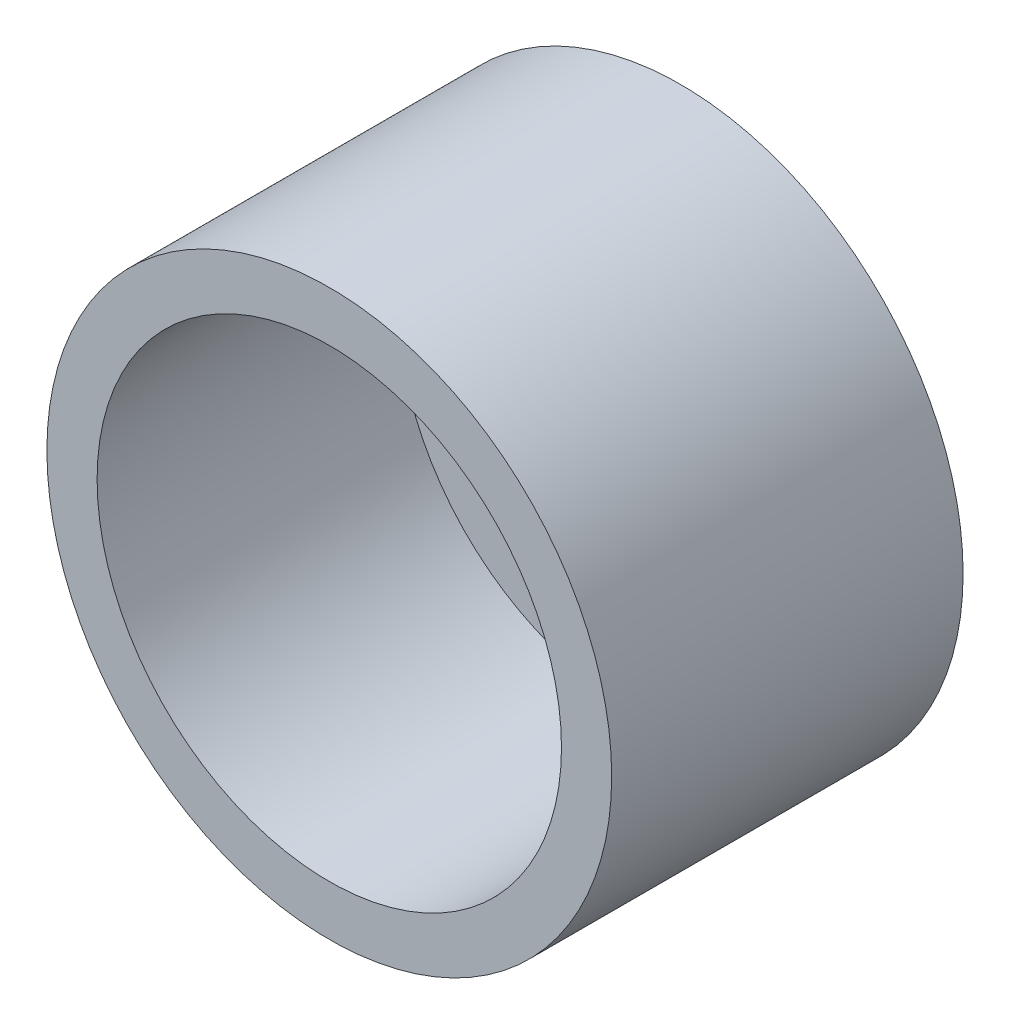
from build123d import *

# Parameters (mm, degrees)
SKETCH1_R           = 14.2875
BOSS_EXTRUDE1_DEPTH = 17.78
SHELL1_T            = -2.54


with BuildPart() as part:
    # Sketch1 → Boss-Extrude1 (new body)
    with BuildSketch(Plane.XY):
        with Locations(Location((0, 0, 0), (0, 0, 180))):
            Circle(SKETCH1_R)
    extrude(amount=BOSS_EXTRUDE1_DEPTH)

    # Shell1
    shell1_openings = [part.faces().sort_by_distance(p)[0] for p in [
        (0, 0, 17.78),
    ]]
    offset(amount=SHELL1_T, openings=shell1_openings, kind=Kind.INTERSECTION)


solid = part.part
